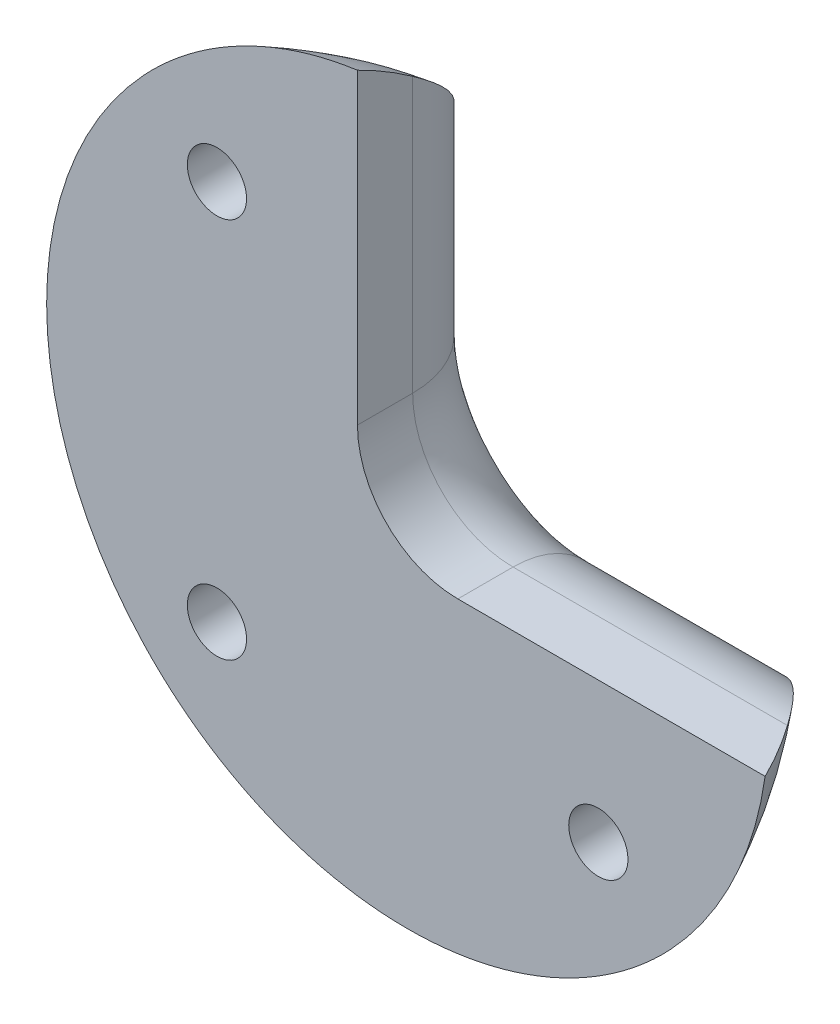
ISO-10303-21;
HEADER;
FILE_DESCRIPTION(('STEP AP214'),'2;1');
FILE_NAME('part.step','',(''),(''),'','','');
FILE_SCHEMA(('AUTOMOTIVE_DESIGN { 1 0 10303 214 1 1 1 1 }'));
ENDSEC;
DATA;
#1=APPLICATION_CONTEXT('core data for automotive mechanical design processes');
#2=APPLICATION_PROTOCOL_DEFINITION('international standard','automotive_design',2000,#1);
#3=PRODUCT_CONTEXT('',#1,'mechanical');
#4=PRODUCT('Part','Part','',(#3));
#5=PRODUCT_RELATED_PRODUCT_CATEGORY('part','',(#4));
#6=PRODUCT_DEFINITION_FORMATION('','',#4);
#7=PRODUCT_DEFINITION_CONTEXT('part definition',#1,'design');
#8=PRODUCT_DEFINITION('design','',#6,#7);
#9=PRODUCT_DEFINITION_SHAPE('','',#8);
#10=(LENGTH_UNIT() NAMED_UNIT(*) SI_UNIT(.MILLI.,.METRE.));
#11=(NAMED_UNIT(*) PLANE_ANGLE_UNIT() SI_UNIT($,.RADIAN.));
#12=(NAMED_UNIT(*) SI_UNIT($,.STERADIAN.) SOLID_ANGLE_UNIT());
#13=UNCERTAINTY_MEASURE_WITH_UNIT(LENGTH_MEASURE(1.E-05),#10,'distance_accuracy_value','');
#14=(GEOMETRIC_REPRESENTATION_CONTEXT(3) GLOBAL_UNCERTAINTY_ASSIGNED_CONTEXT((#13)) GLOBAL_UNIT_ASSIGNED_CONTEXT((#10,
#11,#12)) REPRESENTATION_CONTEXT('',''));
#15=CARTESIAN_POINT('',(0.,0.,0.));
#16=DIRECTION('',(0.,0.,1.));
#17=DIRECTION('',(1.,0.,0.));
#18=AXIS2_PLACEMENT_3D('',#15,#16,#17);
#19=CARTESIAN_POINT('',(-19.,-19.,-40.));
#20=DIRECTION('',(0.,0.,1.));
#21=DIRECTION('',(1.,0.,0.));
#22=AXIS2_PLACEMENT_3D('',#19,#20,#21);
#23=CYLINDRICAL_SURFACE('',#22,2.95);
#24=CARTESIAN_POINT('',(-20.3996851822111,-16.4031978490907,-30.2454615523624));
#25=CARTESIAN_POINT('',(-20.5664860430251,-16.4931039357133,-30.0841977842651));
#26=CARTESIAN_POINT('',(-20.7221306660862,-16.5977094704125,-29.9194106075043));
#27=CARTESIAN_POINT('',(-21.0094178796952,-16.8322198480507,-29.5861999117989));
#28=CARTESIAN_POINT('',(-21.1409868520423,-16.9621998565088,-29.41776694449));
#29=CARTESIAN_POINT('',(-21.3993685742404,-17.2700044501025,-29.0499705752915));
#30=CARTESIAN_POINT('',(-21.5209745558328,-17.4522311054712,-28.850547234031));
#31=CARTESIAN_POINT('',(-21.6722212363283,-17.7454789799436,-28.5558164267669));
#32=CARTESIAN_POINT('',(-21.7174455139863,-17.8465553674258,-28.458299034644));
#33=CARTESIAN_POINT('',(-21.7967667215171,-18.0550015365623,-28.2655191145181));
#34=CARTESIAN_POINT('',(-21.8308677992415,-18.1623689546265,-28.1702557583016));
#35=CARTESIAN_POINT('',(-21.8998080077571,-18.43332731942,-27.9402380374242));
#36=CARTESIAN_POINT('',(-21.9279005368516,-18.6002411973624,-27.8072724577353));
#37=CARTESIAN_POINT('',(-21.9545201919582,-18.9446472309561,-27.5525912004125));
#38=CARTESIAN_POINT('',(-21.9530952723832,-19.1221217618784,-27.4308575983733));
#39=CARTESIAN_POINT('',(-21.920486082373,-19.4375830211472,-27.2341318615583));
#40=CARTESIAN_POINT('',(-21.8971013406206,-19.5738983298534,-27.1551977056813));
#41=CARTESIAN_POINT('',(-21.8289348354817,-19.8482514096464,-27.0105467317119));
#42=CARTESIAN_POINT('',(-21.7841823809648,-19.9862865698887,-26.9448119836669));
#43=CARTESIAN_POINT('',(-21.6821600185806,-20.2340509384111,-26.8418260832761));
#44=CARTESIAN_POINT('',(-21.6289069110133,-20.3441564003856,-26.8015333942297));
#45=CARTESIAN_POINT('',(-21.5068620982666,-20.5599573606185,-26.7349860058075));
#46=CARTESIAN_POINT('',(-21.4380817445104,-20.6656560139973,-26.7087210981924));
#47=CARTESIAN_POINT('',(-21.2854477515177,-20.8696331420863,-26.6721723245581));
#48=CARTESIAN_POINT('',(-21.2015128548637,-20.9678673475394,-26.6619776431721));
#49=CARTESIAN_POINT('',(-21.0212854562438,-21.1525664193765,-26.6587909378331));
#50=CARTESIAN_POINT('',(-20.9249952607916,-21.2390334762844,-26.6657957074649));
#51=CARTESIAN_POINT('',(-20.7325152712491,-21.3905170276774,-26.694989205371));
#52=CARTESIAN_POINT('',(-20.6370608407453,-21.456751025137,-26.7157889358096));
#53=CARTESIAN_POINT('',(-20.4416773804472,-21.5762769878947,-26.7696835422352));
#54=CARTESIAN_POINT('',(-20.3417466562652,-21.6295640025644,-26.8027831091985));
#55=CARTESIAN_POINT('',(-20.1066461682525,-21.7385553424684,-26.892051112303));
#56=CARTESIAN_POINT('',(-19.9706959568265,-21.789290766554,-26.952226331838));
#57=CARTESIAN_POINT('',(-19.6994626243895,-21.8693813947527,-27.0866380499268));
#58=CARTESIAN_POINT('',(-19.5641812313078,-21.8986963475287,-27.160900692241));
#59=CARTESIAN_POINT('',(-19.2488627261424,-21.9452169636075,-27.3483831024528));
#60=CARTESIAN_POINT('',(-19.0702516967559,-21.954260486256,-27.4660014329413));
#61=CARTESIAN_POINT('',(-18.7229682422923,-21.9421148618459,-27.7135306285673));
#62=CARTESIAN_POINT('',(-18.5543124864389,-21.9208764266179,-27.84346121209));
#63=CARTESIAN_POINT('',(-18.1769336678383,-21.841334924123,-28.1537617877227));
#64=CARTESIAN_POINT('',(-17.9726003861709,-21.7733664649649,-28.3369959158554));
#65=CARTESIAN_POINT('',(-17.5877770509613,-21.5986202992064,-28.709742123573));
#66=CARTESIAN_POINT('',(-17.4073070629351,-21.4918102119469,-28.8992593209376));
#67=CARTESIAN_POINT('',(-17.0712321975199,-21.242038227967,-29.281910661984));
#68=CARTESIAN_POINT('',(-16.915977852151,-21.0986280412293,-29.4750599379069));
#69=CARTESIAN_POINT('',(-16.6376157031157,-20.7794474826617,-29.8577568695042));
#70=CARTESIAN_POINT('',(-16.5144890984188,-20.6036961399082,-30.0473065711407));
#71=CARTESIAN_POINT('',(-16.3231296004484,-20.2530533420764,-30.3879386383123));
#72=CARTESIAN_POINT('',(-16.2492705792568,-20.082506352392,-30.5403301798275));
#73=CARTESIAN_POINT('',(-16.133632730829,-19.7225490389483,-30.8347880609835));
#74=CARTESIAN_POINT('',(-16.0918133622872,-19.5331628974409,-30.9768672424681));
#75=CARTESIAN_POINT('',(-16.0519618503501,-19.1857432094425,-31.2133826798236));
#76=CARTESIAN_POINT('',(-16.045910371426,-19.0308941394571,-31.3111374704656));
#77=CARTESIAN_POINT('',(-16.0595666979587,-18.7149412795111,-31.4940394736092));
#78=CARTESIAN_POINT('',(-16.0792402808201,-18.5538460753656,-31.5792032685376));
#79=CARTESIAN_POINT('',(-16.1410334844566,-18.2605148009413,-31.718173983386));
#80=CARTESIAN_POINT('',(-16.1781858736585,-18.1286026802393,-31.7748645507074));
#81=CARTESIAN_POINT('',(-16.2728156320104,-17.8667487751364,-31.8747008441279));
#82=CARTESIAN_POINT('',(-16.3302835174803,-17.7368061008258,-31.9178528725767));
#83=CARTESIAN_POINT('',(-16.4319932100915,-17.5463462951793,-31.9706257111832));
#84=CARTESIAN_POINT('',(-16.468668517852,-17.4833466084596,-31.9862643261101));
#85=CARTESIAN_POINT('',(-16.5470520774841,-17.3596043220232,-32.0131963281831));
#86=CARTESIAN_POINT('',(-16.5887578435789,-17.2988606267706,-32.0244918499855));
#87=CARTESIAN_POINT('',(-16.6769594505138,-17.1802634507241,-32.0425203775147));
#88=CARTESIAN_POINT('',(-16.7234538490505,-17.1224091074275,-32.0492547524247));
#89=CARTESIAN_POINT('',(-16.8208499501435,-17.0101923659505,-32.0580396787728));
#90=CARTESIAN_POINT('',(-16.8717511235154,-16.9558295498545,-32.0600907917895));
#91=CARTESIAN_POINT('',(-17.0176046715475,-16.8114733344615,-32.0592039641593));
#92=CARTESIAN_POINT('',(-17.1167525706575,-16.7256352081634,-32.0513182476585));
#93=CARTESIAN_POINT('',(-17.3240854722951,-16.5687972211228,-32.0213705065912));
#94=CARTESIAN_POINT('',(-17.4322703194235,-16.4977971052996,-31.9993087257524));
#95=CARTESIAN_POINT('',(-17.6533600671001,-16.3722466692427,-31.9425301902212));
#96=CARTESIAN_POINT('',(-17.7662174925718,-16.3175627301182,-31.9079216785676));
#97=CARTESIAN_POINT('',(-17.9944323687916,-16.2239291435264,-31.827682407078));
#98=CARTESIAN_POINT('',(-18.1097902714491,-16.184982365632,-31.7820496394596));
#99=CARTESIAN_POINT('',(-18.3550360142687,-16.1182231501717,-31.6751770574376));
#100=CARTESIAN_POINT('',(-18.4849265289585,-16.0924271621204,-31.6126961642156));
#101=CARTESIAN_POINT('',(-18.7421108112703,-16.0584251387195,-31.4782729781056));
#102=CARTESIAN_POINT('',(-18.8694014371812,-16.0502392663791,-31.4063199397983));
#103=CARTESIAN_POINT('',(-19.1847751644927,-16.0496490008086,-31.2154221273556));
#104=CARTESIAN_POINT('',(-19.3699203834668,-16.0677086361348,-31.0915486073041));
#105=CARTESIAN_POINT('',(-19.7254837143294,-16.1348703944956,-30.8321405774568));
#106=CARTESIAN_POINT('',(-19.8958976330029,-16.1839813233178,-30.6966027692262));
#107=CARTESIAN_POINT('',(-20.1764016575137,-16.29173279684,-30.4551945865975));
#108=CARTESIAN_POINT('',(-20.2904363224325,-16.3443124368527,-30.3510838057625));
#109=CARTESIAN_POINT('',(-20.3996851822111,-16.4031978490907,-30.2454615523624));
#110=B_SPLINE_CURVE_WITH_KNOTS('',3,(#24,#25,#26,#27,#28,#29,#30,#31,#32,#33,#34,#35,#36,#37,
#38,#39,#40,#41,#42,#43,#44,#45,#46,#47,#48,#49,#50,#51,#52,#53,#54,#55,#56,#57,#58,#59,#60,#61,
#62,#63,#64,#65,#66,#67,#68,#69,#70,#71,#72,#73,#74,#75,#76,#77,#78,#79,#80,#81,#82,#83,#84,#85,
#86,#87,#88,#89,#90,#91,#92,#93,#94,#95,#96,#97,#98,#99,#100,#101,#102,#103,#104,#105,#106,#107,
#108,#109),.UNSPECIFIED.,.T.,.F.,(4,2,2,2,2,2,2,2,2,2,2,2,2,2,2,2,2,2,2,2,2,2,2,2,2,2,2,2,2,2,2,
2,2,2,2,2,2,2,2,2,2,2,4),(0.,0.746049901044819,1.49434427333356,2.37858704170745,
2.82078102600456,3.26280992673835,3.90629205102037,4.54872884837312,5.02485305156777,
5.50032605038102,5.88509047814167,6.26957452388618,6.65618491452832,7.04272323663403,
7.39527998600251,7.74797133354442,8.21665876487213,8.68622466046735,9.3248848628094,
9.96458576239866,10.8084333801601,11.6529860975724,12.5084261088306,13.3633643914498,
14.0817781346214,14.7992813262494,15.3470140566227,15.8940188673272,16.3372341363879,
16.7802427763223,17.0036343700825,17.2269160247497,17.4501306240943,17.6733184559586,
18.0653401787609,18.4573551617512,18.8460656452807,19.2348469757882,19.6725257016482,
20.1107052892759,20.7775349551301,21.4445538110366,21.9331909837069),.UNSPECIFIED.);
#111=CARTESIAN_POINT('',(-19.9279601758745,-16.1997518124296,-30.6666666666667));
#112=VERTEX_POINT('',#111);
#113=CARTESIAN_POINT('',(-16.1997518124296,-19.9279601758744,-30.6666666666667));
#114=VERTEX_POINT('',#113);
#115=EDGE_CURVE('E194',#112,#114,#110,.T.);
#116=ORIENTED_EDGE('',*,*,#115,.F.);
#117=CARTESIAN_POINT('',(-19.9279601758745,-16.1997518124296,-30.6666666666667));
#118=CARTESIAN_POINT('',(-19.858620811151,-16.1767695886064,-30.7238788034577));
#119=CARTESIAN_POINT('',(-19.7872835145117,-16.1559928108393,-30.7796119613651));
#120=CARTESIAN_POINT('',(-19.6408620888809,-16.1194635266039,-30.8878615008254));
#121=CARTESIAN_POINT('',(-19.5657741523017,-16.1037162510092,-30.940374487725));
#122=CARTESIAN_POINT('',(-19.411666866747,-16.07781235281,-31.0421872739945));
#123=CARTESIAN_POINT('',(-19.3326221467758,-16.067698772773,-31.0914598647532));
#124=CARTESIAN_POINT('',(-19.1716590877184,-16.0538915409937,-31.1860146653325));
#125=CARTESIAN_POINT('',(-19.0897416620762,-16.050195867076,-31.2312981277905));
#126=CARTESIAN_POINT('',(-18.9230719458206,-16.0498180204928,-31.3178841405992));
#127=CARTESIAN_POINT('',(-18.838303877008,-16.0531849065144,-31.3591567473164));
#128=CARTESIAN_POINT('',(-18.667301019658,-16.0675656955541,-31.4370687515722));
#129=CARTESIAN_POINT('',(-18.5810664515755,-16.0785784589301,-31.4737088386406));
#130=CARTESIAN_POINT('',(-18.4083662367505,-16.1086120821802,-31.542001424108));
#131=CARTESIAN_POINT('',(-18.321902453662,-16.127604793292,-31.573670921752));
#132=CARTESIAN_POINT('',(-18.1494964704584,-16.1738533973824,-31.6319849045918));
#133=CARTESIAN_POINT('',(-18.0635541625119,-16.2011075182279,-31.6586304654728));
#134=CARTESIAN_POINT('',(-17.9056747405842,-16.2593851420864,-31.7032695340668));
#135=CARTESIAN_POINT('',(-17.8335172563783,-16.2892853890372,-31.7219576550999));
#136=CARTESIAN_POINT('',(-17.6910609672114,-16.355129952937,-31.7555271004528));
#137=CARTESIAN_POINT('',(-17.6207628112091,-16.3910763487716,-31.7704071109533));
#138=CARTESIAN_POINT('',(-17.4827466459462,-16.4688514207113,-31.7963186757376));
#139=CARTESIAN_POINT('',(-17.4150287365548,-16.5106803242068,-31.8073500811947));
#140=CARTESIAN_POINT('',(-17.2828415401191,-16.5999496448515,-31.8255503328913));
#141=CARTESIAN_POINT('',(-17.2183733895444,-16.6473920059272,-31.8327178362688));
#142=CARTESIAN_POINT('',(-17.0422538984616,-16.7884751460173,-31.8474444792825));
#143=CARTESIAN_POINT('',(-16.9350054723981,-16.8882359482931,-31.8505549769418));
#144=CARTESIAN_POINT('',(-16.7367624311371,-17.1022245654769,-31.843964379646));
#145=CARTESIAN_POINT('',(-16.6457599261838,-17.2164453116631,-31.8342695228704));
#146=CARTESIAN_POINT('',(-16.4838843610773,-17.4534430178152,-31.8024324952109));
#147=CARTESIAN_POINT('',(-16.4126494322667,-17.5760065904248,-31.7805397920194));
#148=CARTESIAN_POINT('',(-16.289279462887,-17.827757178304,-31.7246031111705));
#149=CARTESIAN_POINT('',(-16.2371450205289,-17.9569444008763,-31.6905587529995));
#150=CARTESIAN_POINT('',(-16.1511635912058,-18.2212619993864,-31.6096177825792));
#151=CARTESIAN_POINT('',(-16.117813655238,-18.3564600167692,-31.5624172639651));
#152=CARTESIAN_POINT('',(-16.0706642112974,-18.6255957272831,-31.4562073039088));
#153=CARTESIAN_POINT('',(-16.056871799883,-18.7595329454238,-31.3971935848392));
#154=CARTESIAN_POINT('',(-16.0467502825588,-19.0334758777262,-31.263034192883));
#155=CARTESIAN_POINT('',(-16.051945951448,-19.1730785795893,-31.1869624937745));
#156=CARTESIAN_POINT('',(-16.0803622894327,-19.4435196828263,-31.0236045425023));
#157=CARTESIAN_POINT('',(-16.1035802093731,-19.5743594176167,-30.9363200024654));
#158=CARTESIAN_POINT('',(-16.1437448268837,-19.7388746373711,-30.8155719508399));
#159=CARTESIAN_POINT('',(-16.154024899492,-19.7774954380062,-30.7863723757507));
#160=CARTESIAN_POINT('',(-16.1759132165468,-19.8535772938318,-30.727145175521));
#161=CARTESIAN_POINT('',(-16.1875186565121,-19.8910405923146,-30.6971193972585));
#162=CARTESIAN_POINT('',(-16.1997518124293,-19.9279601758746,-30.6666666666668));
#163=B_SPLINE_CURVE_WITH_KNOTS('',3,(#117,#118,#119,#120,#121,#122,#123,#124,#125,#126,#127,
#128,#129,#130,#131,#132,#133,#134,#135,#136,#137,#138,#139,#140,#141,#142,#143,#144,#145,#146,
#147,#148,#149,#150,#151,#152,#153,#154,#155,#156,#157,#158,#159,#160,#161,#162),.UNSPECIFIED.,
.F.,.F.,(4,2,2,2,2,2,2,2,2,2,2,2,2,2,2,2,2,2,2,2,2,2,4),(0.,0.278352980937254,0.556994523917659,
0.837736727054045,1.11839045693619,1.40100014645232,1.68356772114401,1.96514681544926,
2.24666555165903,2.48727544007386,2.72796822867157,2.96867032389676,3.20945601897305,
3.64663106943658,4.08359322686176,4.51193043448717,4.94028105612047,5.37948957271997,
5.81885741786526,6.29425439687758,6.76957887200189,6.91804375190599,7.06620010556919),.UNSPECIFIED.);
#164=EDGE_CURVE('E222',#112,#114,#163,.T.);
#165=ORIENTED_EDGE('',*,*,#164,.T.);
#166=EDGE_LOOP('',(#116,#165));
#167=FACE_BOUND('',#166,.T.);
#168=CARTESIAN_POINT('',(-19.,-19.,-17.5));
#169=DIRECTION('',(0.,0.,-1.));
#170=DIRECTION('',(-1.,0.,0.));
#171=AXIS2_PLACEMENT_3D('',#168,#169,#170);
#172=CIRCLE('',#171,2.95);
#173=CARTESIAN_POINT('',(-21.95,-19.,-17.5));
#174=VERTEX_POINT('',#173);
#175=EDGE_CURVE('E266',#174,#174,#172,.T.);
#176=ORIENTED_EDGE('',*,*,#175,.F.);
#177=EDGE_LOOP('',(#176));
#178=FACE_BOUND('',#177,.T.);
#179=ADVANCED_FACE('F36',(#167,#178),#23,.F.);
#180=CARTESIAN_POINT('',(19.,-19.,-40.));
#181=DIRECTION('',(0.,0.,1.));
#182=DIRECTION('',(1.,0.,0.));
#183=AXIS2_PLACEMENT_3D('',#180,#181,#182);
#184=CYLINDRICAL_SURFACE('',#183,2.95);
#185=CARTESIAN_POINT('',(16.4031978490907,-20.3996851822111,-30.2454615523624));
#186=CARTESIAN_POINT('',(16.4931039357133,-20.5664860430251,-30.0841977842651));
#187=CARTESIAN_POINT('',(16.5977094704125,-20.7221306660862,-29.9194106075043));
#188=CARTESIAN_POINT('',(16.8322198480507,-21.0094178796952,-29.5861999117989));
#189=CARTESIAN_POINT('',(16.9621998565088,-21.1409868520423,-29.41776694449));
#190=CARTESIAN_POINT('',(17.2700044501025,-21.3993685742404,-29.0499705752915));
#191=CARTESIAN_POINT('',(17.4522311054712,-21.5209745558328,-28.850547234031));
#192=CARTESIAN_POINT('',(17.7454789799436,-21.6722212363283,-28.5558164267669));
#193=CARTESIAN_POINT('',(17.8465553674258,-21.7174455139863,-28.458299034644));
#194=CARTESIAN_POINT('',(18.0550015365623,-21.7967667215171,-28.2655191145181));
#195=CARTESIAN_POINT('',(18.1623689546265,-21.8308677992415,-28.1702557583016));
#196=CARTESIAN_POINT('',(18.43332731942,-21.8998080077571,-27.9402380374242));
#197=CARTESIAN_POINT('',(18.6002411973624,-21.9279005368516,-27.8072724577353));
#198=CARTESIAN_POINT('',(18.9446472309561,-21.9545201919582,-27.5525912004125));
#199=CARTESIAN_POINT('',(19.1221217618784,-21.9530952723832,-27.4308575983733));
#200=CARTESIAN_POINT('',(19.4375830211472,-21.920486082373,-27.2341318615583));
#201=CARTESIAN_POINT('',(19.5738983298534,-21.8971013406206,-27.1551977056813));
#202=CARTESIAN_POINT('',(19.8482514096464,-21.8289348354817,-27.0105467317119));
#203=CARTESIAN_POINT('',(19.9862865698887,-21.7841823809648,-26.9448119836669));
#204=CARTESIAN_POINT('',(20.2340509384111,-21.6821600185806,-26.8418260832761));
#205=CARTESIAN_POINT('',(20.3441564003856,-21.6289069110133,-26.8015333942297));
#206=CARTESIAN_POINT('',(20.5599573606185,-21.5068620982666,-26.7349860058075));
#207=CARTESIAN_POINT('',(20.6656560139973,-21.4380817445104,-26.7087210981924));
#208=CARTESIAN_POINT('',(20.8696331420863,-21.2854477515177,-26.6721723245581));
#209=CARTESIAN_POINT('',(20.9678673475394,-21.2015128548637,-26.6619776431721));
#210=CARTESIAN_POINT('',(21.1525664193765,-21.0212854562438,-26.6587909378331));
#211=CARTESIAN_POINT('',(21.2390334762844,-20.9249952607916,-26.6657957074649));
#212=CARTESIAN_POINT('',(21.3905170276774,-20.7325152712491,-26.694989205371));
#213=CARTESIAN_POINT('',(21.456751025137,-20.6370608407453,-26.7157889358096));
#214=CARTESIAN_POINT('',(21.5762769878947,-20.4416773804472,-26.7696835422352));
#215=CARTESIAN_POINT('',(21.6295640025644,-20.3417466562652,-26.8027831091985));
#216=CARTESIAN_POINT('',(21.7385553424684,-20.1066461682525,-26.892051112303));
#217=CARTESIAN_POINT('',(21.789290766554,-19.9706959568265,-26.952226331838));
#218=CARTESIAN_POINT('',(21.8693813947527,-19.6994626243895,-27.0866380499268));
#219=CARTESIAN_POINT('',(21.8986963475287,-19.5641812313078,-27.160900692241));
#220=CARTESIAN_POINT('',(21.9452169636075,-19.2488627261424,-27.3483831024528));
#221=CARTESIAN_POINT('',(21.954260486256,-19.0702516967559,-27.4660014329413));
#222=CARTESIAN_POINT('',(21.9421148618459,-18.7229682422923,-27.7135306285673));
#223=CARTESIAN_POINT('',(21.9208764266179,-18.5543124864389,-27.84346121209));
#224=CARTESIAN_POINT('',(21.841334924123,-18.1769336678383,-28.1537617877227));
#225=CARTESIAN_POINT('',(21.7733664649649,-17.9726003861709,-28.3369959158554));
#226=CARTESIAN_POINT('',(21.5986202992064,-17.5877770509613,-28.709742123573));
#227=CARTESIAN_POINT('',(21.4918102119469,-17.4073070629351,-28.8992593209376));
#228=CARTESIAN_POINT('',(21.242038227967,-17.0712321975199,-29.281910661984));
#229=CARTESIAN_POINT('',(21.0986280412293,-16.915977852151,-29.4750599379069));
#230=CARTESIAN_POINT('',(20.7794474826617,-16.6376157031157,-29.8577568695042));
#231=CARTESIAN_POINT('',(20.6036961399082,-16.5144890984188,-30.0473065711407));
#232=CARTESIAN_POINT('',(20.2530533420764,-16.3231296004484,-30.3879386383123));
#233=CARTESIAN_POINT('',(20.082506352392,-16.2492705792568,-30.5403301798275));
#234=CARTESIAN_POINT('',(19.7225490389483,-16.133632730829,-30.8347880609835));
#235=CARTESIAN_POINT('',(19.5331628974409,-16.0918133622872,-30.9768672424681));
#236=CARTESIAN_POINT('',(19.1857432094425,-16.0519618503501,-31.2133826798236));
#237=CARTESIAN_POINT('',(19.0308941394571,-16.045910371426,-31.3111374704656));
#238=CARTESIAN_POINT('',(18.7149412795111,-16.0595666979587,-31.4940394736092));
#239=CARTESIAN_POINT('',(18.5538460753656,-16.0792402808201,-31.5792032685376));
#240=CARTESIAN_POINT('',(18.2605148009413,-16.1410334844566,-31.718173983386));
#241=CARTESIAN_POINT('',(18.1286026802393,-16.1781858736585,-31.7748645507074));
#242=CARTESIAN_POINT('',(17.8667487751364,-16.2728156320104,-31.8747008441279));
#243=CARTESIAN_POINT('',(17.7368061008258,-16.3302835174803,-31.9178528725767));
#244=CARTESIAN_POINT('',(17.5463462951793,-16.4319932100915,-31.9706257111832));
#245=CARTESIAN_POINT('',(17.4833466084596,-16.468668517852,-31.9862643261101));
#246=CARTESIAN_POINT('',(17.3596043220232,-16.5470520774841,-32.0131963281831));
#247=CARTESIAN_POINT('',(17.2988606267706,-16.5887578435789,-32.0244918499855));
#248=CARTESIAN_POINT('',(17.1802634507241,-16.6769594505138,-32.0425203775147));
#249=CARTESIAN_POINT('',(17.1224091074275,-16.7234538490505,-32.0492547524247));
#250=CARTESIAN_POINT('',(17.0101923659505,-16.8208499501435,-32.0580396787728));
#251=CARTESIAN_POINT('',(16.9558295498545,-16.8717511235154,-32.0600907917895));
#252=CARTESIAN_POINT('',(16.8114733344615,-17.0176046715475,-32.0592039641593));
#253=CARTESIAN_POINT('',(16.7256352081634,-17.1167525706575,-32.0513182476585));
#254=CARTESIAN_POINT('',(16.5687972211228,-17.3240854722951,-32.0213705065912));
#255=CARTESIAN_POINT('',(16.4977971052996,-17.4322703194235,-31.9993087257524));
#256=CARTESIAN_POINT('',(16.3722466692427,-17.6533600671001,-31.9425301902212));
#257=CARTESIAN_POINT('',(16.3175627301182,-17.7662174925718,-31.9079216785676));
#258=CARTESIAN_POINT('',(16.2239291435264,-17.9944323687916,-31.827682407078));
#259=CARTESIAN_POINT('',(16.184982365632,-18.1097902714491,-31.7820496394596));
#260=CARTESIAN_POINT('',(16.1182231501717,-18.3550360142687,-31.6751770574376));
#261=CARTESIAN_POINT('',(16.0924271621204,-18.4849265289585,-31.6126961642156));
#262=CARTESIAN_POINT('',(16.0584251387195,-18.7421108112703,-31.4782729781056));
#263=CARTESIAN_POINT('',(16.0502392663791,-18.8694014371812,-31.4063199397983));
#264=CARTESIAN_POINT('',(16.0496490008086,-19.1847751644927,-31.2154221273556));
#265=CARTESIAN_POINT('',(16.0677086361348,-19.3699203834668,-31.0915486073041));
#266=CARTESIAN_POINT('',(16.1348703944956,-19.7254837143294,-30.8321405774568));
#267=CARTESIAN_POINT('',(16.1839813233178,-19.8958976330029,-30.6966027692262));
#268=CARTESIAN_POINT('',(16.29173279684,-20.1764016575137,-30.4551945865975));
#269=CARTESIAN_POINT('',(16.3443124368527,-20.2904363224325,-30.3510838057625));
#270=CARTESIAN_POINT('',(16.4031978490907,-20.3996851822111,-30.2454615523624));
#271=B_SPLINE_CURVE_WITH_KNOTS('',3,(#185,#186,#187,#188,#189,#190,#191,#192,#193,#194,#195,
#196,#197,#198,#199,#200,#201,#202,#203,#204,#205,#206,#207,#208,#209,#210,#211,#212,#213,#214,
#215,#216,#217,#218,#219,#220,#221,#222,#223,#224,#225,#226,#227,#228,#229,#230,#231,#232,#233,
#234,#235,#236,#237,#238,#239,#240,#241,#242,#243,#244,#245,#246,#247,#248,#249,#250,#251,#252,
#253,#254,#255,#256,#257,#258,#259,#260,#261,#262,#263,#264,#265,#266,#267,#268,#269,#270),
.UNSPECIFIED.,.T.,.F.,(4,2,2,2,2,2,2,2,2,2,2,2,2,2,2,2,2,2,2,2,2,2,2,2,2,2,2,2,2,2,2,2,2,2,2,2,
2,2,2,2,2,2,4),(0.,0.746049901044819,1.49434427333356,2.37858704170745,2.82078102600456,
3.26280992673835,3.90629205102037,4.54872884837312,5.02485305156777,5.50032605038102,
5.88509047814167,6.26957452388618,6.65618491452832,7.04272323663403,7.39527998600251,
7.74797133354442,8.21665876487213,8.68622466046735,9.3248848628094,9.96458576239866,
10.8084333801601,11.6529860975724,12.5084261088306,13.3633643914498,14.0817781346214,
14.7992813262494,15.3470140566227,15.8940188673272,16.3372341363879,16.7802427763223,
17.0036343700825,17.2269160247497,17.4501306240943,17.6733184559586,18.0653401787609,
18.4573551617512,18.8460656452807,19.2348469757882,19.6725257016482,20.1107052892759,
20.7775349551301,21.4445538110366,21.9331909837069),.UNSPECIFIED.);
#272=CARTESIAN_POINT('',(16.1997518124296,-19.9279601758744,-30.6666666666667));
#273=VERTEX_POINT('',#272);
#274=CARTESIAN_POINT('',(19.9279601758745,-16.1997518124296,-30.6666666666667));
#275=VERTEX_POINT('',#274);
#276=EDGE_CURVE('E201',#273,#275,#271,.T.);
#277=ORIENTED_EDGE('',*,*,#276,.F.);
#278=CARTESIAN_POINT('',(16.1997518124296,-19.9279601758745,-30.6666666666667));
#279=CARTESIAN_POINT('',(16.1767695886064,-19.858620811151,-30.7238788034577));
#280=CARTESIAN_POINT('',(16.1559928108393,-19.7872835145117,-30.7796119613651));
#281=CARTESIAN_POINT('',(16.1194635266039,-19.6408620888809,-30.8878615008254));
#282=CARTESIAN_POINT('',(16.1037162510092,-19.5657741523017,-30.940374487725));
#283=CARTESIAN_POINT('',(16.07781235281,-19.411666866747,-31.0421872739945));
#284=CARTESIAN_POINT('',(16.067698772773,-19.3326221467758,-31.0914598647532));
#285=CARTESIAN_POINT('',(16.0538915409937,-19.1716590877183,-31.1860146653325));
#286=CARTESIAN_POINT('',(16.050195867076,-19.0897416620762,-31.2312981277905));
#287=CARTESIAN_POINT('',(16.0498180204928,-18.9230719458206,-31.3178841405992));
#288=CARTESIAN_POINT('',(16.0531849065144,-18.838303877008,-31.3591567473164));
#289=CARTESIAN_POINT('',(16.0675656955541,-18.667301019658,-31.4370687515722));
#290=CARTESIAN_POINT('',(16.0785784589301,-18.5810664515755,-31.4737088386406));
#291=CARTESIAN_POINT('',(16.1086120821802,-18.4083662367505,-31.542001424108));
#292=CARTESIAN_POINT('',(16.127604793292,-18.321902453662,-31.573670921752));
#293=CARTESIAN_POINT('',(16.1738533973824,-18.1494964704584,-31.6319849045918));
#294=CARTESIAN_POINT('',(16.2011075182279,-18.0635541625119,-31.6586304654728));
#295=CARTESIAN_POINT('',(16.2593851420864,-17.9056747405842,-31.7032695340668));
#296=CARTESIAN_POINT('',(16.2892853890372,-17.8335172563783,-31.7219576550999));
#297=CARTESIAN_POINT('',(16.355129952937,-17.6910609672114,-31.7555271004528));
#298=CARTESIAN_POINT('',(16.3910763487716,-17.6207628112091,-31.7704071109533));
#299=CARTESIAN_POINT('',(16.4688514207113,-17.4827466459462,-31.7963186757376));
#300=CARTESIAN_POINT('',(16.5106803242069,-17.4150287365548,-31.8073500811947));
#301=CARTESIAN_POINT('',(16.5999496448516,-17.2828415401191,-31.8255503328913));
#302=CARTESIAN_POINT('',(16.6473920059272,-17.2183733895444,-31.8327178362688));
#303=CARTESIAN_POINT('',(16.7884751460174,-17.0422538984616,-31.8474444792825));
#304=CARTESIAN_POINT('',(16.8882359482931,-16.9350054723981,-31.8505549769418));
#305=CARTESIAN_POINT('',(17.1022245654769,-16.7367624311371,-31.843964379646));
#306=CARTESIAN_POINT('',(17.2164453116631,-16.6457599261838,-31.8342695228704));
#307=CARTESIAN_POINT('',(17.4534430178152,-16.4838843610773,-31.8024324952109));
#308=CARTESIAN_POINT('',(17.5760065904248,-16.4126494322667,-31.7805397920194));
#309=CARTESIAN_POINT('',(17.8277571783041,-16.289279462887,-31.7246031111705));
#310=CARTESIAN_POINT('',(17.9569444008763,-16.2371450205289,-31.6905587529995));
#311=CARTESIAN_POINT('',(18.2212619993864,-16.1511635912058,-31.6096177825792));
#312=CARTESIAN_POINT('',(18.3564600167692,-16.117813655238,-31.5624172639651));
#313=CARTESIAN_POINT('',(18.6255957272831,-16.0706642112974,-31.4562073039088));
#314=CARTESIAN_POINT('',(18.7595329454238,-16.056871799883,-31.3971935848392));
#315=CARTESIAN_POINT('',(19.0334758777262,-16.0467502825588,-31.263034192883));
#316=CARTESIAN_POINT('',(19.1730785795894,-16.051945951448,-31.1869624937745));
#317=CARTESIAN_POINT('',(19.4435196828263,-16.0803622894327,-31.0236045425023));
#318=CARTESIAN_POINT('',(19.5743594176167,-16.1035802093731,-30.9363200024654));
#319=CARTESIAN_POINT('',(19.7388746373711,-16.1437448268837,-30.8155719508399));
#320=CARTESIAN_POINT('',(19.7774954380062,-16.154024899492,-30.7863723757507));
#321=CARTESIAN_POINT('',(19.8535772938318,-16.1759132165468,-30.727145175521));
#322=CARTESIAN_POINT('',(19.8910405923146,-16.1875186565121,-30.6971193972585));
#323=CARTESIAN_POINT('',(19.9279601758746,-16.1997518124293,-30.6666666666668));
#324=B_SPLINE_CURVE_WITH_KNOTS('',3,(#278,#279,#280,#281,#282,#283,#284,#285,#286,#287,#288,
#289,#290,#291,#292,#293,#294,#295,#296,#297,#298,#299,#300,#301,#302,#303,#304,#305,#306,#307,
#308,#309,#310,#311,#312,#313,#314,#315,#316,#317,#318,#319,#320,#321,#322,#323),.UNSPECIFIED.,
.F.,.F.,(4,2,2,2,2,2,2,2,2,2,2,2,2,2,2,2,2,2,2,2,2,2,4),(0.,0.278352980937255,0.556994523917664,
0.837736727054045,1.11839045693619,1.40100014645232,1.68356772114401,1.96514681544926,
2.24666555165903,2.48727544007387,2.72796822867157,2.96867032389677,3.20945601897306,
3.64663106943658,4.08359322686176,4.51193043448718,4.94028105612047,5.37948957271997,
5.81885741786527,6.29425439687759,6.76957887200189,6.91804375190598,7.06620010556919),.UNSPECIFIED.);
#325=EDGE_CURVE('E217',#273,#275,#324,.T.);
#326=ORIENTED_EDGE('',*,*,#325,.T.);
#327=EDGE_LOOP('',(#277,#326));
#328=FACE_BOUND('',#327,.T.);
#329=CARTESIAN_POINT('',(19.,-19.,-17.5));
#330=DIRECTION('',(0.,0.,-1.));
#331=DIRECTION('',(-1.,0.,0.));
#332=AXIS2_PLACEMENT_3D('',#329,#330,#331);
#333=CIRCLE('',#332,2.95);
#334=CARTESIAN_POINT('',(16.05,-19.,-17.5));
#335=VERTEX_POINT('',#334);
#336=EDGE_CURVE('E207',#335,#335,#333,.T.);
#337=ORIENTED_EDGE('',*,*,#336,.F.);
#338=EDGE_LOOP('',(#337));
#339=FACE_BOUND('',#338,.T.);
#340=ADVANCED_FACE('F208',(#328,#339),#184,.F.);
#341=CARTESIAN_POINT('',(-19.,19.,-40.));
#342=DIRECTION('',(0.,0.,1.));
#343=DIRECTION('',(1.,0.,0.));
#344=AXIS2_PLACEMENT_3D('',#341,#342,#343);
#345=CYLINDRICAL_SURFACE('',#344,2.95);
#346=CARTESIAN_POINT('',(-20.3996851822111,16.4031978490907,-30.2454615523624));
#347=CARTESIAN_POINT('',(-20.2319175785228,16.3127658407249,-30.4076592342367));
#348=CARTESIAN_POINT('',(-20.0526906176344,16.2370877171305,-30.5664752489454));
#349=CARTESIAN_POINT('',(-19.6735956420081,16.1211097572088,-30.8726754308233));
#350=CARTESIAN_POINT('',(-19.4737253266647,16.0808138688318,-31.0200583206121));
#351=CARTESIAN_POINT('',(-19.1178777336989,16.0486135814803,-31.2566886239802));
#352=CARTESIAN_POINT('',(-18.9658571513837,16.0461077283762,-31.350447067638));
#353=CARTESIAN_POINT('',(-18.6563690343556,16.0659989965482,-31.5254680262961));
#354=CARTESIAN_POINT('',(-18.4989112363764,16.0883536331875,-31.6067515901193));
#355=CARTESIAN_POINT('',(-18.2105771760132,16.1544434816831,-31.7400435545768));
#356=CARTESIAN_POINT('',(-18.0799019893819,16.1937212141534,-31.7946865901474));
#357=CARTESIAN_POINT('',(-17.8209429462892,16.292337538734,-31.8903612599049));
#358=CARTESIAN_POINT('',(-17.6926582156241,16.3516686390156,-31.9313979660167));
#359=CARTESIAN_POINT('',(-17.5050218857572,16.4558413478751,-31.9810095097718));
#360=CARTESIAN_POINT('',(-17.4430355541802,16.4932763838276,-31.9955903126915));
#361=CARTESIAN_POINT('',(-17.3214088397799,16.5730454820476,-32.0204370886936));
#362=CARTESIAN_POINT('',(-17.261767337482,16.6153771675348,-32.0307051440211));
#363=CARTESIAN_POINT('',(-17.1454432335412,16.7046800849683,-32.0467296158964));
#364=CARTESIAN_POINT('',(-17.0887598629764,16.7516501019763,-32.0524872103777));
#365=CARTESIAN_POINT('',(-16.9789303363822,16.8498342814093,-32.0593894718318));
#366=CARTESIAN_POINT('',(-16.9257837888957,16.901047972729,-32.060534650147));
#367=CARTESIAN_POINT('',(-16.7843707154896,17.0479819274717,-32.0572632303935));
#368=CARTESIAN_POINT('',(-16.7003396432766,17.1477785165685,-32.047921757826));
#369=CARTESIAN_POINT('',(-16.5471549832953,17.3559816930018,-32.0152863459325));
#370=CARTESIAN_POINT('',(-16.4780007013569,17.4643878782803,-31.9919930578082));
#371=CARTESIAN_POINT('',(-16.3555642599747,17.6864106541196,-31.932793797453));
#372=CARTESIAN_POINT('',(-16.3022701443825,17.8000232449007,-31.8968973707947));
#373=CARTESIAN_POINT('',(-16.2114711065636,18.0295010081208,-31.8141834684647));
#374=CARTESIAN_POINT('',(-16.1739734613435,18.1453671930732,-31.7673609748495));
#375=CARTESIAN_POINT('',(-16.102630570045,18.4211716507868,-31.6448737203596));
#376=CARTESIAN_POINT('',(-16.0756515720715,18.5810388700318,-31.5650235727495));
#377=CARTESIAN_POINT('',(-16.0475907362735,18.8957791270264,-31.3919888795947));
#378=CARTESIAN_POINT('',(-16.046559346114,19.0506418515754,-31.2987787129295));
#379=CARTESIAN_POINT('',(-16.0703245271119,19.397691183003,-31.0729644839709));
#380=CARTESIAN_POINT('',(-16.1029774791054,19.5871053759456,-30.9369406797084));
#381=CARTESIAN_POINT('',(-16.2003509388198,19.948450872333,-30.6539252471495));
#382=CARTESIAN_POINT('',(-16.2650962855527,20.120368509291,-30.5069251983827));
#383=CARTESIAN_POINT('',(-16.423145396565,20.447750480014,-30.203095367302));
#384=CARTESIAN_POINT('',(-16.5169809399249,20.6028290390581,-30.046129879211));
#385=CARTESIAN_POINT('',(-16.7287180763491,20.8909686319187,-29.728348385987));
#386=CARTESIAN_POINT('',(-16.846627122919,21.024022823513,-29.5675312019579));
#387=CARTESIAN_POINT('',(-17.1310681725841,21.2925159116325,-29.2102654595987));
#388=CARTESIAN_POINT('',(-17.3026052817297,21.4223588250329,-29.0135644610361));
#389=CARTESIAN_POINT('',(-17.6728388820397,21.6434147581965,-28.6237277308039));
#390=CARTESIAN_POINT('',(-17.8715394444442,21.7346219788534,-28.4305925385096));
#391=CARTESIAN_POINT('',(-18.2473715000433,21.8576737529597,-28.0949757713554));
#392=CARTESIAN_POINT('',(-18.4199585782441,21.8980642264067,-27.9505297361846));
#393=CARTESIAN_POINT('',(-18.7779127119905,21.9471551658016,-27.6724431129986));
#394=CARTESIAN_POINT('',(-18.9632571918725,21.9559102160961,-27.5387843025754));
#395=CARTESIAN_POINT('',(-19.2916154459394,21.938811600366,-27.323059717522));
#396=CARTESIAN_POINT('',(-19.4323691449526,21.9217550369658,-27.2368715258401));
#397=CARTESIAN_POINT('',(-19.7167589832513,21.8652566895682,-27.0774301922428));
#398=CARTESIAN_POINT('',(-19.8603907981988,21.8258463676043,-27.0041590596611));
#399=CARTESIAN_POINT('',(-20.1177890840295,21.7327282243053,-26.888296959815));
#400=CARTESIAN_POINT('',(-20.2317243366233,21.6835200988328,-26.8424982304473));
#401=CARTESIAN_POINT('',(-20.4560878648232,21.5686856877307,-26.7648579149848));
#402=CARTESIAN_POINT('',(-20.5665186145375,21.5030712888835,-26.733006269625));
#403=CARTESIAN_POINT('',(-20.7808963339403,21.3554072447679,-26.6855494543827));
#404=CARTESIAN_POINT('',(-20.8847939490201,21.2732485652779,-26.6700565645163));
#405=CARTESIAN_POINT('',(-21.0811189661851,21.0949930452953,-26.6571809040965));
#406=CARTESIAN_POINT('',(-21.17355095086,20.9989018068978,-26.6597908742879));
#407=CARTESIAN_POINT('',(-21.3343723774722,20.8075171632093,-26.681562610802));
#408=CARTESIAN_POINT('',(-21.4042840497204,20.7132773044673,-26.6988901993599));
#409=CARTESIAN_POINT('',(-21.5311877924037,20.5195415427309,-26.7464080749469));
#410=CARTESIAN_POINT('',(-21.5881774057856,20.4200446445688,-26.7766008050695));
#411=CARTESIAN_POINT('',(-21.6916607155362,20.2130802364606,-26.8499300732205));
#412=CARTESIAN_POINT('',(-21.737433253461,20.1054705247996,-26.8936706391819));
#413=CARTESIAN_POINT('',(-21.8149538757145,19.8897731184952,-26.9911144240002));
#414=CARTESIAN_POINT('',(-21.8466936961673,19.7816851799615,-27.0448234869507));
#415=CARTESIAN_POINT('',(-21.9115087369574,19.5055757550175,-27.1929475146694));
#416=CARTESIAN_POINT('',(-21.935089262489,19.3384076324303,-27.2931478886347));
#417=CARTESIAN_POINT('',(-21.9545578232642,19.0109599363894,-27.5067142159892));
#418=CARTESIAN_POINT('',(-21.9503764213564,18.8506986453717,-27.620112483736));
#419=CARTESIAN_POINT('',(-21.9123149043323,18.4845658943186,-27.8969749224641));
#420=CARTESIAN_POINT('',(-21.8685188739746,18.2824466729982,-28.0640339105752));
#421=CARTESIAN_POINT('',(-21.743869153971,17.8979103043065,-28.4066786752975));
#422=CARTESIAN_POINT('',(-21.6629695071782,17.7155179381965,-28.5822747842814));
#423=CARTESIAN_POINT('',(-21.466605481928,17.3694390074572,-28.9406387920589));
#424=CARTESIAN_POINT('',(-21.3504645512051,17.2062142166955,-29.1234799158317));
#425=CARTESIAN_POINT('',(-21.0877571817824,16.9063459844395,-29.4882132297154));
#426=CARTESIAN_POINT('',(-20.941268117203,16.7696366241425,-29.670106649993));
#427=CARTESIAN_POINT('',(-20.6613666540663,16.5577102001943,-29.9831703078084));
#428=CARTESIAN_POINT('',(-20.5342099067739,16.4757109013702,-30.1154030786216));
#429=CARTESIAN_POINT('',(-20.3996851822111,16.4031978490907,-30.2454615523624));
#430=B_SPLINE_CURVE_WITH_KNOTS('',3,(#346,#347,#348,#349,#350,#351,#352,#353,#354,#355,#356,
#357,#358,#359,#360,#361,#362,#363,#364,#365,#366,#367,#368,#369,#370,#371,#372,#373,#374,#375,
#376,#377,#378,#379,#380,#381,#382,#383,#384,#385,#386,#387,#388,#389,#390,#391,#392,#393,#394,
#395,#396,#397,#398,#399,#400,#401,#402,#403,#404,#405,#406,#407,#408,#409,#410,#411,#412,#413,
#414,#415,#416,#417,#418,#419,#420,#421,#422,#423,#424,#425,#426,#427,#428,#429),.UNSPECIFIED.,
.T.,.F.,(4,2,2,2,2,2,2,2,2,2,2,2,2,2,2,2,2,2,2,2,2,2,2,2,2,2,2,2,2,2,2,2,2,2,2,2,2,2,2,2,2,4),
(0.,0.750240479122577,1.50056465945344,2.0345865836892,2.56769730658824,3.00694334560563,
3.44602546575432,3.66735293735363,3.8885734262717,4.10973612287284,4.33087430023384,
4.72118102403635,5.1114695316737,5.50146307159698,5.89163607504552,6.43084580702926,
6.97110379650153,7.67374901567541,8.37693892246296,9.09382778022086,9.81093893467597,
10.6816821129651,11.5525559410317,12.2362351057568,12.9187340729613,13.414878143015,
13.9103256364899,14.305635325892,14.700659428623,15.0983775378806,15.4959361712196,
15.850183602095,16.2044983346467,16.5776942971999,16.9511097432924,17.5367667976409,
18.123889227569,18.9172412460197,19.7115785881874,20.5222500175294,21.3308794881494,
21.9324610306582),.UNSPECIFIED.);
#431=CARTESIAN_POINT('',(-16.1997518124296,19.9279601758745,-30.6666666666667));
#432=VERTEX_POINT('',#431);
#433=CARTESIAN_POINT('',(-19.9279601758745,16.1997518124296,-30.6666666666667));
#434=VERTEX_POINT('',#433);
#435=EDGE_CURVE('E129',#432,#434,#430,.T.);
#436=ORIENTED_EDGE('',*,*,#435,.F.);
#437=CARTESIAN_POINT('',(-16.1997518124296,19.9279601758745,-30.6666666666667));
#438=CARTESIAN_POINT('',(-16.1767695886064,19.858620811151,-30.7238788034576));
#439=CARTESIAN_POINT('',(-16.1559928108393,19.7872835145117,-30.7796119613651));
#440=CARTESIAN_POINT('',(-16.1194635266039,19.6408620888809,-30.8878615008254));
#441=CARTESIAN_POINT('',(-16.1037162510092,19.5657741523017,-30.940374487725));
#442=CARTESIAN_POINT('',(-16.07781235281,19.411666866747,-31.0421872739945));
#443=CARTESIAN_POINT('',(-16.067698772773,19.3326221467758,-31.0914598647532));
#444=CARTESIAN_POINT('',(-16.0538915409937,19.1716590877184,-31.1860146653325));
#445=CARTESIAN_POINT('',(-16.050195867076,19.0897416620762,-31.2312981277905));
#446=CARTESIAN_POINT('',(-16.0498180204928,18.9230719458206,-31.3178841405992));
#447=CARTESIAN_POINT('',(-16.0531849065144,18.838303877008,-31.3591567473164));
#448=CARTESIAN_POINT('',(-16.0675656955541,18.667301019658,-31.4370687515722));
#449=CARTESIAN_POINT('',(-16.0785784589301,18.5810664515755,-31.4737088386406));
#450=CARTESIAN_POINT('',(-16.1086120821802,18.4083662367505,-31.542001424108));
#451=CARTESIAN_POINT('',(-16.127604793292,18.321902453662,-31.573670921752));
#452=CARTESIAN_POINT('',(-16.1738533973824,18.1494964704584,-31.6319849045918));
#453=CARTESIAN_POINT('',(-16.2011075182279,18.0635541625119,-31.6586304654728));
#454=CARTESIAN_POINT('',(-16.2593851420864,17.9056747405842,-31.7032695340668));
#455=CARTESIAN_POINT('',(-16.2892853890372,17.8335172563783,-31.7219576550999));
#456=CARTESIAN_POINT('',(-16.355129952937,17.6910609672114,-31.7555271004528));
#457=CARTESIAN_POINT('',(-16.3910763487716,17.6207628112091,-31.7704071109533));
#458=CARTESIAN_POINT('',(-16.4688514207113,17.4827466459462,-31.7963186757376));
#459=CARTESIAN_POINT('',(-16.5106803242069,17.4150287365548,-31.8073500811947));
#460=CARTESIAN_POINT('',(-16.5999496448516,17.2828415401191,-31.8255503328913));
#461=CARTESIAN_POINT('',(-16.6473920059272,17.2183733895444,-31.8327178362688));
#462=CARTESIAN_POINT('',(-16.7884751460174,17.0422538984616,-31.8474444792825));
#463=CARTESIAN_POINT('',(-16.8882359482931,16.9350054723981,-31.8505549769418));
#464=CARTESIAN_POINT('',(-17.1022245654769,16.7367624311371,-31.843964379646));
#465=CARTESIAN_POINT('',(-17.2164453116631,16.6457599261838,-31.8342695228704));
#466=CARTESIAN_POINT('',(-17.4534430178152,16.4838843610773,-31.8024324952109));
#467=CARTESIAN_POINT('',(-17.5760065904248,16.4126494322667,-31.7805397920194));
#468=CARTESIAN_POINT('',(-17.8277571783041,16.289279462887,-31.7246031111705));
#469=CARTESIAN_POINT('',(-17.9569444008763,16.2371450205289,-31.6905587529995));
#470=CARTESIAN_POINT('',(-18.2212619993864,16.1511635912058,-31.6096177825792));
#471=CARTESIAN_POINT('',(-18.3564600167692,16.117813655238,-31.5624172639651));
#472=CARTESIAN_POINT('',(-18.6255957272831,16.0706642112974,-31.4562073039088));
#473=CARTESIAN_POINT('',(-18.7595329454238,16.056871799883,-31.3971935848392));
#474=CARTESIAN_POINT('',(-19.0334758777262,16.0467502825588,-31.263034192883));
#475=CARTESIAN_POINT('',(-19.1730785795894,16.051945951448,-31.1869624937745));
#476=CARTESIAN_POINT('',(-19.4435196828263,16.0803622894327,-31.0236045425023));
#477=CARTESIAN_POINT('',(-19.5743594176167,16.1035802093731,-30.9363200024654));
#478=CARTESIAN_POINT('',(-19.7388746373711,16.1437448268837,-30.8155719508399));
#479=CARTESIAN_POINT('',(-19.7774954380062,16.154024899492,-30.7863723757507));
#480=CARTESIAN_POINT('',(-19.8535772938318,16.1759132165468,-30.727145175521));
#481=CARTESIAN_POINT('',(-19.8910405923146,16.1875186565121,-30.6971193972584));
#482=CARTESIAN_POINT('',(-19.9279601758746,16.1997518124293,-30.6666666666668));
#483=B_SPLINE_CURVE_WITH_KNOTS('',3,(#437,#438,#439,#440,#441,#442,#443,#444,#445,#446,#447,
#448,#449,#450,#451,#452,#453,#454,#455,#456,#457,#458,#459,#460,#461,#462,#463,#464,#465,#466,
#467,#468,#469,#470,#471,#472,#473,#474,#475,#476,#477,#478,#479,#480,#481,#482),.UNSPECIFIED.,
.F.,.F.,(4,2,2,2,2,2,2,2,2,2,2,2,2,2,2,2,2,2,2,2,2,2,4),(0.,0.278352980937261,0.556994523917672,
0.837736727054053,1.11839045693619,1.40100014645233,1.68356772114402,1.96514681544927,
2.24666555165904,2.48727544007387,2.72796822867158,2.96867032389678,3.20945601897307,
3.64663106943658,4.08359322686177,4.51193043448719,4.94028105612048,5.37948957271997,
5.81885741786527,6.2942543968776,6.76957887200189,6.918043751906,7.0662001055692),.UNSPECIFIED.);
#484=EDGE_CURVE('E50',#432,#434,#483,.T.);
#485=ORIENTED_EDGE('',*,*,#484,.T.);
#486=EDGE_LOOP('',(#436,#485));
#487=FACE_BOUND('',#486,.T.);
#488=CARTESIAN_POINT('',(-19.,19.,-17.5));
#489=DIRECTION('',(0.,0.,-1.));
#490=DIRECTION('',(-1.,0.,0.));
#491=AXIS2_PLACEMENT_3D('',#488,#489,#490);
#492=CIRCLE('',#491,2.95);
#493=CARTESIAN_POINT('',(-21.95,19.,-17.5));
#494=VERTEX_POINT('',#493);
#495=EDGE_CURVE('E206',#494,#494,#492,.T.);
#496=ORIENTED_EDGE('',*,*,#495,.F.);
#497=EDGE_LOOP('',(#496));
#498=FACE_BOUND('',#497,.T.);
#499=ADVANCED_FACE('F176',(#487,#498),#345,.F.);
#500=CARTESIAN_POINT('',(0.,0.,0.));
#501=DIRECTION('',(0.,-1.,0.));
#502=DIRECTION('',(1.,0.,0.));
#503=AXIS2_PLACEMENT_3D('',#500,#501,#502);
#504=SPHERICAL_SURFACE('',#503,40.);
#505=CARTESIAN_POINT('',(0.,-5.,0.));
#506=DIRECTION('',(0.,-1.,0.));
#507=DIRECTION('',(0.,0.,-1.));
#508=AXIS2_PLACEMENT_3D('',#505,#506,#507);
#509=CIRCLE('',#508,39.6862696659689);
#510=CARTESIAN_POINT('',(32.3419232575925,-5.,-23.));
#511=VERTEX_POINT('',#510);
#512=CARTESIAN_POINT('',(35.6195171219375,-5.,-17.5));
#513=VERTEX_POINT('',#512);
#514=EDGE_CURVE('E131',#511,#513,#509,.T.);
#515=ORIENTED_EDGE('',*,*,#514,.T.);
#516=CARTESIAN_POINT('',(0.,0.,-17.5));
#517=DIRECTION('',(0.,0.,-1.));
#518=DIRECTION('',(-1.,0.,0.));
#519=AXIS2_PLACEMENT_3D('',#516,#517,#518);
#520=CIRCLE('',#519,35.9687364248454);
#521=CARTESIAN_POINT('',(-5.,35.6195171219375,-17.5));
#522=VERTEX_POINT('',#521);
#523=EDGE_CURVE('E120',#513,#522,#520,.T.);
#524=ORIENTED_EDGE('',*,*,#523,.T.);
#525=CARTESIAN_POINT('',(-5.,0.,0.));
#526=DIRECTION('',(-1.,0.,0.));
#527=DIRECTION('',(0.,0.,1.));
#528=AXIS2_PLACEMENT_3D('',#525,#526,#527);
#529=CIRCLE('',#528,39.6862696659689);
#530=CARTESIAN_POINT('',(-5.,32.3419232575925,-23.));
#531=VERTEX_POINT('',#530);
#532=EDGE_CURVE('E135',#522,#531,#529,.T.);
#533=ORIENTED_EDGE('',*,*,#532,.T.);
#534=CARTESIAN_POINT('',(-5.,32.3419232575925,-23.));
#535=CARTESIAN_POINT('',(-5.00003351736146,32.0924548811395,-23.3508146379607));
#536=CARTESIAN_POINT('',(-5.01845270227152,31.8355323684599,-23.6959816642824));
#537=CARTESIAN_POINT('',(-5.08879783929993,31.3092760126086,-24.3724764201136));
#538=CARTESIAN_POINT('',(-5.14067765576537,31.0399597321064,-24.7038225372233));
#539=CARTESIAN_POINT('',(-5.27312826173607,30.49714495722,-25.3435299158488));
#540=CARTESIAN_POINT('',(-5.35299879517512,30.2238920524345,-25.6522477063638));
#541=CARTESIAN_POINT('',(-5.53891984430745,29.6687605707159,-26.2537853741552));
#542=CARTESIAN_POINT('',(-5.64498111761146,29.3868784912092,-26.5465986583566));
#543=CARTESIAN_POINT('',(-5.92088530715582,28.7188809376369,-27.211858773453));
#544=CARTESIAN_POINT('',(-6.1001544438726,28.3298996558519,-27.5775482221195));
#545=CARTESIAN_POINT('',(-6.49595873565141,27.5418221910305,-28.2766246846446));
#546=CARTESIAN_POINT('',(-6.71251360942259,27.1427207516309,-28.6099944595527));
#547=CARTESIAN_POINT('',(-7.18593463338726,26.3237241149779,-29.2534027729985));
#548=CARTESIAN_POINT('',(-7.44388790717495,25.9035758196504,-29.5623210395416));
#549=CARTESIAN_POINT('',(-7.85349517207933,25.2695050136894,-29.9976511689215));
#550=CARTESIAN_POINT('',(-7.9937320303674,25.0576173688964,-30.1380212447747));
#551=CARTESIAN_POINT('',(-8.28136780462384,24.6327474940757,-30.4093879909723));
#552=CARTESIAN_POINT('',(-8.42876589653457,24.4197653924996,-30.5403857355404));
#553=CARTESIAN_POINT('',(-8.57954657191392,24.2063408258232,-30.6666666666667));
#554=B_SPLINE_CURVE_WITH_KNOTS('',3,(#534,#535,#536,#537,#538,#539,#540,#541,#542,#543,#544,
#545,#546,#547,#548,#549,#550,#551,#552,#553),.UNSPECIFIED.,.F.,.F.,(4,2,2,2,2,2,2,2,2,4),(0.,
1.29051465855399,2.57925374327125,3.83781645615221,5.09689697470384,6.78389169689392,
8.47178134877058,10.214897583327,11.0855547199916,11.9561119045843),.UNSPECIFIED.);
#555=CARTESIAN_POINT('',(-8.57954657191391,24.2063408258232,-30.6666666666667));
#556=VERTEX_POINT('',#555);
#557=EDGE_CURVE('E66',#531,#556,#554,.T.);
#558=ORIENTED_EDGE('',*,*,#557,.T.);
#559=CARTESIAN_POINT('',(0.,0.,-30.6666666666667));
#560=DIRECTION('',(0.,0.,1.));
#561=DIRECTION('',(0.,-1.,0.));
#562=AXIS2_PLACEMENT_3D('',#559,#560,#561);
#563=CIRCLE('',#562,25.6818137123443);
#564=EDGE_CURVE('E291',#556,#432,#563,.T.);
#565=ORIENTED_EDGE('',*,*,#564,.T.);
#566=ORIENTED_EDGE('',*,*,#435,.T.);
#567=CARTESIAN_POINT('',(0.,0.,-30.6666666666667));
#568=DIRECTION('',(0.,0.,1.));
#569=DIRECTION('',(0.,-1.,0.));
#570=AXIS2_PLACEMENT_3D('',#567,#568,#569);
#571=CIRCLE('',#570,25.6818137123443);
#572=EDGE_CURVE('E292',#434,#112,#571,.T.);
#573=ORIENTED_EDGE('',*,*,#572,.T.);
#574=ORIENTED_EDGE('',*,*,#115,.T.);
#575=CARTESIAN_POINT('',(0.,0.,-30.6666666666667));
#576=DIRECTION('',(0.,0.,1.));
#577=DIRECTION('',(0.,-1.,0.));
#578=AXIS2_PLACEMENT_3D('',#575,#576,#577);
#579=CIRCLE('',#578,25.6818137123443);
#580=EDGE_CURVE('E169',#114,#273,#579,.T.);
#581=ORIENTED_EDGE('',*,*,#580,.T.);
#582=ORIENTED_EDGE('',*,*,#276,.T.);
#583=CARTESIAN_POINT('',(0.,0.,-30.6666666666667));
#584=DIRECTION('',(0.,0.,1.));
#585=DIRECTION('',(0.,-1.,0.));
#586=AXIS2_PLACEMENT_3D('',#583,#584,#585);
#587=CIRCLE('',#586,25.6818137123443);
#588=CARTESIAN_POINT('',(24.2063408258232,-8.57954657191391,-30.6666666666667));
#589=VERTEX_POINT('',#588);
#590=EDGE_CURVE('E162',#275,#589,#587,.T.);
#591=ORIENTED_EDGE('',*,*,#590,.T.);
#592=CARTESIAN_POINT('',(24.2063408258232,-8.57954657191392,-30.6666666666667));
#593=CARTESIAN_POINT('',(24.4208373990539,-8.42800866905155,-30.5397513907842));
#594=CARTESIAN_POINT('',(24.6348868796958,-8.27988736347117,-30.408071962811));
#595=CARTESIAN_POINT('',(25.0618793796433,-7.99087928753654,-30.1352478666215));
#596=CARTESIAN_POINT('',(25.2748222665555,-7.84999336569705,-29.9941020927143));
#597=CARTESIAN_POINT('',(25.9120513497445,-7.43854977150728,-29.5562941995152));
#598=CARTESIAN_POINT('',(26.3342781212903,-7.17953223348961,-29.2455333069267));
#599=CARTESIAN_POINT('',(27.1571821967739,-6.70445530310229,-28.5982122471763));
#600=CARTESIAN_POINT('',(27.5581174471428,-6.48729001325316,-28.2627897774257));
#601=CARTESIAN_POINT('',(28.3497173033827,-6.09070801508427,-27.5593203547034));
#602=CARTESIAN_POINT('',(28.7403874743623,-5.9112704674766,-27.191291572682));
#603=CARTESIAN_POINT('',(29.4079024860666,-5.63687692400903,-26.5249866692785));
#604=CARTESIAN_POINT('',(29.6877388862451,-5.53210549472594,-26.2337166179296));
#605=CARTESIAN_POINT('',(30.2388625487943,-5.34847206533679,-25.6354984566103));
#606=CARTESIAN_POINT('',(30.5101532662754,-5.26959946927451,-25.3285568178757));
#607=CARTESIAN_POINT('',(31.0490704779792,-5.13883307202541,-24.692704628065));
#608=CARTESIAN_POINT('',(31.3164553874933,-5.08762735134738,-24.3634447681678));
#609=CARTESIAN_POINT('',(31.8389979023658,-5.0182046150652,-23.6913248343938));
#610=CARTESIAN_POINT('',(32.094138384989,-5.00003255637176,-23.34844687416));
#611=CARTESIAN_POINT('',(32.3419232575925,-4.99999999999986,-23.0000000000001));
#612=B_SPLINE_CURVE_WITH_KNOTS('',3,(#592,#593,#594,#595,#596,#597,#598,#599,#600,#601,#602,
#603,#604,#605,#606,#607,#608,#609,#610,#611),.UNSPECIFIED.,.F.,.F.,(4,2,2,2,2,2,2,2,2,4),(0.,
0.874928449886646,1.74995927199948,3.50189247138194,5.19799787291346,6.89316393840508,
8.14394460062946,9.39421289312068,10.6742908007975,11.9561095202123),.UNSPECIFIED.);
#613=EDGE_CURVE('E134',#589,#511,#612,.T.);
#614=ORIENTED_EDGE('',*,*,#613,.T.);
#615=EDGE_LOOP('',(#515,#524,#533,#558,#565,#566,#573,#574,#581,#582,#591,#614));
#616=FACE_BOUND('',#615,.T.);
#617=ADVANCED_FACE('F132',(#616),#504,.T.);
#618=CARTESIAN_POINT('',(-5.,-5.,-40.));
#619=DIRECTION('',(-1.,0.,0.));
#620=DIRECTION('',(0.,0.,1.));
#621=AXIS2_PLACEMENT_3D('',#618,#619,#620);
#622=PLANE('',#621);
#623=DIRECTION('',(0.,0.,1.));
#624=VECTOR('',#623,1.);
#625=CARTESIAN_POINT('',(-5.,5.,-39.3700393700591));
#626=LINE('',#625,#624);
#627=CARTESIAN_POINT('',(-5.,5.,-17.5));
#628=VERTEX_POINT('',#627);
#629=CARTESIAN_POINT('',(-5.,5.,-23.));
#630=VERTEX_POINT('',#629);
#631=EDGE_CURVE('E145',#628,#630,#626,.F.);
#632=ORIENTED_EDGE('',*,*,#631,.T.);
#633=DIRECTION('',(0.,-1.,0.));
#634=VECTOR('',#633,1.);
#635=CARTESIAN_POINT('',(-5.,22.0454076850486,-23.));
#636=LINE('',#635,#634);
#637=EDGE_CURVE('E159',#630,#531,#636,.F.);
#638=ORIENTED_EDGE('',*,*,#637,.T.);
#639=ORIENTED_EDGE('',*,*,#532,.F.);
#640=DIRECTION('',(0.,1.,0.));
#641=VECTOR('',#640,1.);
#642=CARTESIAN_POINT('',(-5.,0.,-17.5));
#643=LINE('',#642,#641);
#644=EDGE_CURVE('E127',#628,#522,#643,.T.);
#645=ORIENTED_EDGE('',*,*,#644,.F.);
#646=EDGE_LOOP('',(#632,#638,#639,#645));
#647=FACE_BOUND('',#646,.T.);
#648=ADVANCED_FACE('F175',(#647),#622,.F.);
#649=CARTESIAN_POINT('',(-5.,-5.,-40.));
#650=DIRECTION('',(0.,-1.,0.));
#651=DIRECTION('',(0.,0.,-1.));
#652=AXIS2_PLACEMENT_3D('',#649,#650,#651);
#653=PLANE('',#652);
#654=ORIENTED_EDGE('',*,*,#514,.F.);
#655=DIRECTION('',(1.,0.,0.));
#656=VECTOR('',#655,1.);
#657=CARTESIAN_POINT('',(5.,-5.,-23.));
#658=LINE('',#657,#656);
#659=CARTESIAN_POINT('',(5.,-5.,-23.));
#660=VERTEX_POINT('',#659);
#661=EDGE_CURVE('E58',#511,#660,#658,.F.);
#662=ORIENTED_EDGE('',*,*,#661,.T.);
#663=DIRECTION('',(0.,0.,1.));
#664=VECTOR('',#663,1.);
#665=CARTESIAN_POINT('',(5.,-5.,-17.5));
#666=LINE('',#665,#664);
#667=CARTESIAN_POINT('',(5.,-5.,-17.5));
#668=VERTEX_POINT('',#667);
#669=EDGE_CURVE('E138',#660,#668,#666,.T.);
#670=ORIENTED_EDGE('',*,*,#669,.T.);
#671=DIRECTION('',(-1.,0.,0.));
#672=VECTOR('',#671,1.);
#673=CARTESIAN_POINT('',(0.,-5.,-17.5));
#674=LINE('',#673,#672);
#675=EDGE_CURVE('E125',#513,#668,#674,.T.);
#676=ORIENTED_EDGE('',*,*,#675,.F.);
#677=EDGE_LOOP('',(#654,#662,#670,#676));
#678=FACE_BOUND('',#677,.T.);
#679=ADVANCED_FACE('F137',(#678),#653,.F.);
#680=CARTESIAN_POINT('',(5.,5.,-40.));
#681=DIRECTION('',(0.,0.,-1.));
#682=DIRECTION('',(-1.,0.,0.));
#683=AXIS2_PLACEMENT_3D('',#680,#681,#682);
#684=CYLINDRICAL_SURFACE('',#683,10.);
#685=ORIENTED_EDGE('',*,*,#669,.F.);
#686=CARTESIAN_POINT('',(5.,5.,-23.));
#687=DIRECTION('',(0.,0.,-1.));
#688=DIRECTION('',(0.,1.,0.));
#689=AXIS2_PLACEMENT_3D('',#686,#687,#688);
#690=CIRCLE('',#689,10.);
#691=EDGE_CURVE('E12',#660,#630,#690,.T.);
#692=ORIENTED_EDGE('',*,*,#691,.T.);
#693=ORIENTED_EDGE('',*,*,#631,.F.);
#694=CARTESIAN_POINT('',(5.,5.,-17.5));
#695=DIRECTION('',(0.,0.,-1.));
#696=DIRECTION('',(-1.,0.,0.));
#697=AXIS2_PLACEMENT_3D('',#694,#695,#696);
#698=CIRCLE('',#697,10.);
#699=EDGE_CURVE('E148',#668,#628,#698,.T.);
#700=ORIENTED_EDGE('',*,*,#699,.F.);
#701=EDGE_LOOP('',(#685,#692,#693,#700));
#702=FACE_BOUND('',#701,.T.);
#703=ADVANCED_FACE('F178',(#702),#684,.F.);
#704=CARTESIAN_POINT('',(0.,0.,-17.5));
#705=DIRECTION('',(0.,0.,-1.));
#706=DIRECTION('',(-1.,0.,0.));
#707=AXIS2_PLACEMENT_3D('',#704,#705,#706);
#708=PLANE('',#707);
#709=ORIENTED_EDGE('',*,*,#523,.F.);
#710=ORIENTED_EDGE('',*,*,#675,.T.);
#711=ORIENTED_EDGE('',*,*,#699,.T.);
#712=ORIENTED_EDGE('',*,*,#644,.T.);
#713=EDGE_LOOP('',(#709,#710,#711,#712));
#714=FACE_BOUND('',#713,.T.);
#715=ORIENTED_EDGE('',*,*,#175,.T.);
#716=EDGE_LOOP('',(#715));
#717=FACE_BOUND('',#716,.T.);
#718=ORIENTED_EDGE('',*,*,#495,.T.);
#719=EDGE_LOOP('',(#718));
#720=FACE_BOUND('',#719,.T.);
#721=ORIENTED_EDGE('',*,*,#336,.T.);
#722=EDGE_LOOP('',(#721));
#723=FACE_BOUND('',#722,.T.);
#724=ADVANCED_FACE('F122',(#714,#717,#720,#723),#708,.F.);
#725=CARTESIAN_POINT('',(-40.,41.7668788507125,-33.));
#726=DIRECTION('',(0.,0.,-1.));
#727=DIRECTION('',(0.,1.,0.));
#728=AXIS2_PLACEMENT_3D('',#725,#726,#727);
#729=PLANE('',#728);
#730=DIRECTION('',(1.,0.,0.));
#731=VECTOR('',#730,1.);
#732=CARTESIAN_POINT('',(22.0454076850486,-15.,-33.));
#733=LINE('',#732,#731);
#734=CARTESIAN_POINT('',(5.,-15.,-33.));
#735=VERTEX_POINT('',#734);
#736=CARTESIAN_POINT('',(12.0830459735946,-15.,-33.));
#737=VERTEX_POINT('',#736);
#738=EDGE_CURVE('E152',#735,#737,#733,.T.);
#739=ORIENTED_EDGE('',*,*,#738,.T.);
#740=CARTESIAN_POINT('',(0.,0.,-33.));
#741=DIRECTION('',(0.,0.,-1.));
#742=DIRECTION('',(0.,1.,0.));
#743=AXIS2_PLACEMENT_3D('',#740,#741,#742);
#744=CIRCLE('',#743,19.2613602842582);
#745=CARTESIAN_POINT('',(-15.,12.0830459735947,-33.));
#746=VERTEX_POINT('',#745);
#747=EDGE_CURVE('E157',#737,#746,#744,.T.);
#748=ORIENTED_EDGE('',*,*,#747,.T.);
#749=DIRECTION('',(0.,-1.,0.));
#750=VECTOR('',#749,1.);
#751=CARTESIAN_POINT('',(-15.,5.,-33.));
#752=LINE('',#751,#750);
#753=CARTESIAN_POINT('',(-15.,5.,-33.));
#754=VERTEX_POINT('',#753);
#755=EDGE_CURVE('E154',#746,#754,#752,.T.);
#756=ORIENTED_EDGE('',*,*,#755,.T.);
#757=CARTESIAN_POINT('',(5.,5.,-33.));
#758=DIRECTION('',(0.,0.,-1.));
#759=DIRECTION('',(0.,1.,0.));
#760=AXIS2_PLACEMENT_3D('',#757,#758,#759);
#761=CIRCLE('',#760,20.);
#762=EDGE_CURVE('E150',#754,#735,#761,.F.);
#763=ORIENTED_EDGE('',*,*,#762,.T.);
#764=EDGE_LOOP('',(#739,#748,#756,#763));
#765=FACE_BOUND('',#764,.T.);
#766=ADVANCED_FACE('F302',(#765),#729,.T.);
#767=CARTESIAN_POINT('',(-40.,-15.,-23.));
#768=DIRECTION('',(-1.,0.,0.));
#769=DIRECTION('',(0.,0.,1.));
#770=AXIS2_PLACEMENT_3D('',#767,#768,#769);
#771=CYLINDRICAL_SURFACE('',#770,10.);
#772=ORIENTED_EDGE('',*,*,#661,.F.);
#773=ORIENTED_EDGE('',*,*,#613,.F.);
#774=CARTESIAN_POINT('',(24.2063408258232,-8.57954657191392,-30.6666666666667));
#775=CARTESIAN_POINT('',(24.0012561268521,-8.72445036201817,-30.7879931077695));
#776=CARTESIAN_POINT('',(23.7927881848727,-8.8698887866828,-30.9028263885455));
#777=CARTESIAN_POINT('',(23.369856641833,-9.16097854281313,-31.1202776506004));
#778=CARTESIAN_POINT('',(23.1553955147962,-9.3066297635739,-31.2229005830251));
#779=CARTESIAN_POINT('',(22.7215148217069,-9.59711712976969,-31.4166056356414));
#780=CARTESIAN_POINT('',(22.5021060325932,-9.74195432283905,-31.5077104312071));
#781=CARTESIAN_POINT('',(22.058448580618,-10.0304670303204,-31.6793962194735));
#782=CARTESIAN_POINT('',(21.8341993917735,-10.1741424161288,-31.7599760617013));
#783=CARTESIAN_POINT('',(21.1580652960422,-10.6005585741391,-31.9859906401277));
#784=CARTESIAN_POINT('',(20.6997141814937,-10.8807583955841,-32.1170467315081));
#785=CARTESIAN_POINT('',(19.768567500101,-11.4306836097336,-32.3460536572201));
#786=CARTESIAN_POINT('',(19.2957651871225,-11.7004039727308,-32.4439887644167));
#787=CARTESIAN_POINT('',(18.4479656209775,-12.1660307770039,-32.5923822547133));
#788=CARTESIAN_POINT('',(18.0754446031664,-12.3646629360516,-32.6485786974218));
#789=CARTESIAN_POINT('',(17.3239475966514,-12.7528910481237,-32.7463103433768));
#790=CARTESIAN_POINT('',(16.9449730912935,-12.9424890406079,-32.7878488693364));
#791=CARTESIAN_POINT('',(16.1808364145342,-13.311897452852,-32.8582799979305));
#792=CARTESIAN_POINT('',(15.7956703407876,-13.4917013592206,-32.8871642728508));
#793=CARTESIAN_POINT('',(15.0198784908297,-13.8405845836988,-32.934119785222));
#794=CARTESIAN_POINT('',(14.6292528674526,-14.0096642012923,-32.9521913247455));
#795=CARTESIAN_POINT('',(13.9511971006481,-14.2914071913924,-32.9755702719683));
#796=CARTESIAN_POINT('',(13.6649620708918,-14.406787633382,-32.9830219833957));
#797=CARTESIAN_POINT('',(13.0900643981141,-14.6312581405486,-32.9938307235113));
#798=CARTESIAN_POINT('',(12.8014026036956,-14.7403503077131,-32.9971891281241));
#799=CARTESIAN_POINT('',(12.3769096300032,-14.8953666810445,-32.9995734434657));
#800=CARTESIAN_POINT('',(12.2420089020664,-14.9438359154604,-32.9999563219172));
#801=CARTESIAN_POINT('',(12.0989209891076,-14.9943985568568,-32.9999988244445));
#802=CARTESIAN_POINT('',(12.0909839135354,-14.9972005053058,-33.0000000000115));
#803=CARTESIAN_POINT('',(12.0830459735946,-15.,-33.));
#804=B_SPLINE_CURVE_WITH_KNOTS('',3,(#774,#775,#776,#777,#778,#779,#780,#781,#782,#783,#784,
#785,#786,#787,#788,#789,#790,#791,#792,#793,#794,#795,#796,#797,#798,#799,#800,#801,#802,#803),
.UNSPECIFIED.,.F.,.F.,(4,2,2,2,2,2,2,2,2,2,2,2,2,2,4),(0.,0.836472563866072,1.67260478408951,
2.50706442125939,3.34161519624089,4.99891029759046,6.65699124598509,7.93426628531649,
9.21125160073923,10.4890760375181,11.766864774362,12.6928865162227,13.6185968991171,
14.048621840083,14.0738732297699),.UNSPECIFIED.);
#805=EDGE_CURVE('E41',#737,#589,#804,.F.);
#806=ORIENTED_EDGE('',*,*,#805,.F.);
#807=ORIENTED_EDGE('',*,*,#738,.F.);
#808=CARTESIAN_POINT('',(5.,-15.,-23.));
#809=DIRECTION('',(-1.,0.,0.));
#810=DIRECTION('',(0.,0.,1.));
#811=AXIS2_PLACEMENT_3D('',#808,#809,#810);
#812=CIRCLE('',#811,10.);
#813=EDGE_CURVE('E280',#660,#735,#812,.T.);
#814=ORIENTED_EDGE('',*,*,#813,.F.);
#815=EDGE_LOOP('',(#772,#773,#806,#807,#814));
#816=FACE_BOUND('',#815,.T.);
#817=ADVANCED_FACE('F38',(#816),#771,.T.);
#818=CARTESIAN_POINT('',(0.,0.,-23.));
#819=DIRECTION('',(0.,0.,-1.));
#820=DIRECTION('',(0.,1.,0.));
#821=AXIS2_PLACEMENT_3D('',#818,#819,#820);
#822=TOROIDAL_SURFACE('',#821,19.2613602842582,10.);
#823=ORIENTED_EDGE('',*,*,#484,.F.);
#824=ORIENTED_EDGE('',*,*,#564,.F.);
#825=CARTESIAN_POINT('',(-8.57954657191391,24.2063408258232,-30.6666666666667));
#826=CARTESIAN_POINT('',(-8.72445036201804,24.0012561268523,-30.7879931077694));
#827=CARTESIAN_POINT('',(-8.86988878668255,23.7927881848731,-30.9028263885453));
#828=CARTESIAN_POINT('',(-9.16097854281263,23.3698566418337,-31.1202776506));
#829=CARTESIAN_POINT('',(-9.30662976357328,23.1553955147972,-31.2229005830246));
#830=CARTESIAN_POINT('',(-9.59711712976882,22.7215148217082,-31.4166056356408));
#831=CARTESIAN_POINT('',(-9.74195432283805,22.5021060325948,-31.5077104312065));
#832=CARTESIAN_POINT('',(-10.0304670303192,22.0584485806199,-31.6793962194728));
#833=CARTESIAN_POINT('',(-10.1741424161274,21.8341993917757,-31.7599760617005));
#834=CARTESIAN_POINT('',(-10.6005585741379,21.1580652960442,-31.9859906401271));
#835=CARTESIAN_POINT('',(-10.8807583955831,20.6997141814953,-32.1170467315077));
#836=CARTESIAN_POINT('',(-11.4306836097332,19.7685675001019,-32.3460536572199));
#837=CARTESIAN_POINT('',(-11.7004039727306,19.2957651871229,-32.4439887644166));
#838=CARTESIAN_POINT('',(-12.166030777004,18.4479656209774,-32.5923822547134));
#839=CARTESIAN_POINT('',(-12.3646629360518,18.0754446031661,-32.6485786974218));
#840=CARTESIAN_POINT('',(-12.752891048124,17.3239475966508,-32.7463103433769));
#841=CARTESIAN_POINT('',(-12.9424890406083,16.9449730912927,-32.7878488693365));
#842=CARTESIAN_POINT('',(-13.3118974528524,16.1808364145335,-32.8582799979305));
#843=CARTESIAN_POINT('',(-13.491701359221,15.7956703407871,-32.8871642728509));
#844=CARTESIAN_POINT('',(-13.8405845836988,15.0198784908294,-32.934119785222));
#845=CARTESIAN_POINT('',(-14.0096642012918,14.6292528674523,-32.9521913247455));
#846=CARTESIAN_POINT('',(-14.2914071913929,13.9511971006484,-32.9755702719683));
#847=CARTESIAN_POINT('',(-14.4067876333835,13.6649620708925,-32.9830219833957));
#848=CARTESIAN_POINT('',(-14.6312581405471,13.0900643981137,-32.9938307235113));
#849=CARTESIAN_POINT('',(-14.7403503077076,12.8014026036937,-32.9971891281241));
#850=CARTESIAN_POINT('',(-14.8953666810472,12.3769096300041,-32.9995734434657));
#851=CARTESIAN_POINT('',(-14.9438359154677,12.242008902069,-32.9999563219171));
#852=CARTESIAN_POINT('',(-14.9943985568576,12.0989209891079,-32.9999988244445));
#853=CARTESIAN_POINT('',(-14.9972005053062,12.0909839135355,-33.0000000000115));
#854=CARTESIAN_POINT('',(-15.,12.0830459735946,-33.));
#855=B_SPLINE_CURVE_WITH_KNOTS('',3,(#825,#826,#827,#828,#829,#830,#831,#832,#833,#834,#835,
#836,#837,#838,#839,#840,#841,#842,#843,#844,#845,#846,#847,#848,#849,#850,#851,#852,#853,#854),
.UNSPECIFIED.,.F.,.F.,(4,2,2,2,2,2,2,2,2,2,2,2,2,2,4),(0.,0.836472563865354,1.67260478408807,
2.50706442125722,3.34161519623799,4.99891029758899,6.65699124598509,7.93426628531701,
9.21125160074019,10.4890760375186,11.766864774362,12.6928865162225,13.6185968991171,
14.048621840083,14.0738732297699),.UNSPECIFIED.);
#856=EDGE_CURVE('E237',#746,#556,#855,.F.);
#857=ORIENTED_EDGE('',*,*,#856,.F.);
#858=ORIENTED_EDGE('',*,*,#747,.F.);
#859=ORIENTED_EDGE('',*,*,#805,.T.);
#860=ORIENTED_EDGE('',*,*,#590,.F.);
#861=ORIENTED_EDGE('',*,*,#325,.F.);
#862=ORIENTED_EDGE('',*,*,#580,.F.);
#863=ORIENTED_EDGE('',*,*,#164,.F.);
#864=ORIENTED_EDGE('',*,*,#572,.F.);
#865=EDGE_LOOP('',(#823,#824,#857,#858,#859,#860,#861,#862,#863,#864));
#866=FACE_BOUND('',#865,.T.);
#867=ADVANCED_FACE('F227',(#866),#822,.T.);
#868=CARTESIAN_POINT('',(5.,5.,-23.));
#869=DIRECTION('',(0.,0.,-1.));
#870=DIRECTION('',(0.,1.,0.));
#871=AXIS2_PLACEMENT_3D('',#868,#869,#870);
#872=TOROIDAL_SURFACE('',#871,20.,10.);
#873=ORIENTED_EDGE('',*,*,#813,.T.);
#874=ORIENTED_EDGE('',*,*,#762,.F.);
#875=CARTESIAN_POINT('',(-15.,5.,-23.));
#876=DIRECTION('',(0.,1.,0.));
#877=DIRECTION('',(0.,0.,1.));
#878=AXIS2_PLACEMENT_3D('',#875,#876,#877);
#879=CIRCLE('',#878,10.);
#880=EDGE_CURVE('E274',#630,#754,#879,.T.);
#881=ORIENTED_EDGE('',*,*,#880,.F.);
#882=ORIENTED_EDGE('',*,*,#691,.F.);
#883=EDGE_LOOP('',(#873,#874,#881,#882));
#884=FACE_BOUND('',#883,.T.);
#885=ADVANCED_FACE('F230',(#884),#872,.T.);
#886=CARTESIAN_POINT('',(-15.,41.7668788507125,-23.));
#887=DIRECTION('',(0.,1.,0.));
#888=DIRECTION('',(0.,0.,1.));
#889=AXIS2_PLACEMENT_3D('',#886,#887,#888);
#890=CYLINDRICAL_SURFACE('',#889,10.);
#891=ORIENTED_EDGE('',*,*,#557,.F.);
#892=ORIENTED_EDGE('',*,*,#637,.F.);
#893=ORIENTED_EDGE('',*,*,#880,.T.);
#894=ORIENTED_EDGE('',*,*,#755,.F.);
#895=ORIENTED_EDGE('',*,*,#856,.T.);
#896=EDGE_LOOP('',(#891,#892,#893,#894,#895));
#897=FACE_BOUND('',#896,.T.);
#898=ADVANCED_FACE('F232',(#897),#890,.T.);
#899=CLOSED_SHELL('',(#179,#340,#499,#617,#648,#679,#703,#724,#766,#817,#867,#885,#898));
#900=MANIFOLD_SOLID_BREP('B2',#899);
#901=ADVANCED_BREP_SHAPE_REPRESENTATION('',(#18,#900),#14);
#902=SHAPE_DEFINITION_REPRESENTATION(#9,#901);
ENDSEC;
END-ISO-10303-21;
